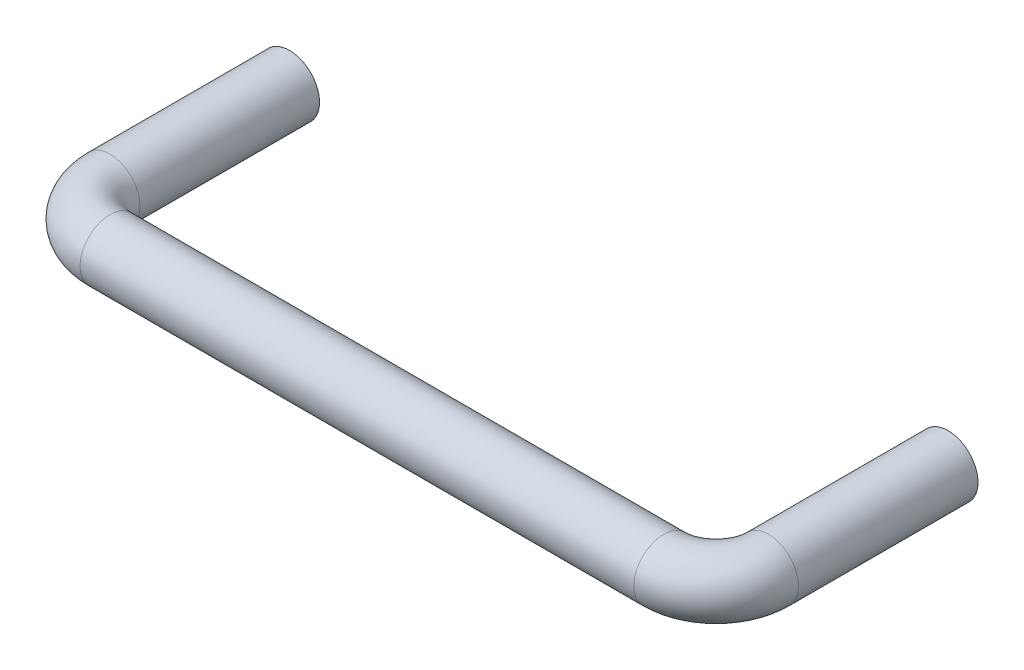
ISO-10303-21;
HEADER;
FILE_DESCRIPTION(('STEP AP214'),'2;1');
FILE_NAME('part.step','',(''),(''),'','','');
FILE_SCHEMA(('AUTOMOTIVE_DESIGN { 1 0 10303 214 1 1 1 1 }'));
ENDSEC;
DATA;
#1=APPLICATION_CONTEXT('core data for automotive mechanical design processes');
#2=APPLICATION_PROTOCOL_DEFINITION('international standard','automotive_design',2000,#1);
#3=PRODUCT_CONTEXT('',#1,'mechanical');
#4=PRODUCT('Part','Part','',(#3));
#5=PRODUCT_RELATED_PRODUCT_CATEGORY('part','',(#4));
#6=PRODUCT_DEFINITION_FORMATION('','',#4);
#7=PRODUCT_DEFINITION_CONTEXT('part definition',#1,'design');
#8=PRODUCT_DEFINITION('design','',#6,#7);
#9=PRODUCT_DEFINITION_SHAPE('','',#8);
#10=(LENGTH_UNIT() NAMED_UNIT(*) SI_UNIT(.MILLI.,.METRE.));
#11=(NAMED_UNIT(*) PLANE_ANGLE_UNIT() SI_UNIT($,.RADIAN.));
#12=(NAMED_UNIT(*) SI_UNIT($,.STERADIAN.) SOLID_ANGLE_UNIT());
#13=UNCERTAINTY_MEASURE_WITH_UNIT(LENGTH_MEASURE(1.E-05),#10,'distance_accuracy_value','');
#14=(GEOMETRIC_REPRESENTATION_CONTEXT(3) GLOBAL_UNCERTAINTY_ASSIGNED_CONTEXT((#13)) GLOBAL_UNIT_ASSIGNED_CONTEXT((#10,
#11,#12)) REPRESENTATION_CONTEXT('',''));
#15=CARTESIAN_POINT('',(0.,0.,0.));
#16=DIRECTION('',(0.,0.,1.));
#17=DIRECTION('',(1.,0.,0.));
#18=AXIS2_PLACEMENT_3D('',#15,#16,#17);
#19=CARTESIAN_POINT('',(-2.53,2.538705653,10.));
#20=DIRECTION('',(0.,0.,-1.));
#21=DIRECTION('',(1.,0.,0.));
#22=AXIS2_PLACEMENT_3D('',#19,#20,#21);
#23=PLANE('',#22);
#24=CARTESIAN_POINT('',(0.,0.,10.));
#25=DIRECTION('',(0.,0.,-1.));
#26=DIRECTION('',(0.,1.,0.));
#27=AXIS2_PLACEMENT_3D('',#24,#25,#26);
#28=CIRCLE('',#27,2.5);
#29=CARTESIAN_POINT('',(0.,2.5,10.));
#30=VERTEX_POINT('',#29);
#31=EDGE_CURVE('E33',#30,#30,#28,.T.);
#32=ORIENTED_EDGE('',*,*,#31,.T.);
#33=EDGE_LOOP('',(#32));
#34=FACE_BOUND('',#33,.T.);
#35=ADVANCED_FACE('F12',(#34),#23,.T.);
#36=CARTESIAN_POINT('',(0.,0.,10.));
#37=DIRECTION('',(0.,0.,-1.));
#38=DIRECTION('',(0.,1.,0.));
#39=AXIS2_PLACEMENT_3D('',#36,#37,#38);
#40=CYLINDRICAL_SURFACE('',#39,2.5);
#41=CARTESIAN_POINT('',(0.,0.,0.449999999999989));
#42=DIRECTION('',(0.,0.,1.));
#43=DIRECTION('',(1.,0.,0.));
#44=AXIS2_PLACEMENT_3D('',#41,#42,#43);
#45=CIRCLE('',#44,2.5);
#46=CARTESIAN_POINT('',(2.5,0.,0.449999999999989));
#47=VERTEX_POINT('',#46);
#48=EDGE_CURVE('E19',#47,#47,#45,.F.);
#49=ORIENTED_EDGE('',*,*,#48,.T.);
#50=EDGE_LOOP('',(#49));
#51=FACE_BOUND('',#50,.T.);
#52=ORIENTED_EDGE('',*,*,#31,.F.);
#53=EDGE_LOOP('',(#52));
#54=FACE_BOUND('',#53,.T.);
#55=ADVANCED_FACE('F77',(#51,#54),#40,.F.);
#56=CARTESIAN_POINT('',(-4.06192904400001,4.048,0.));
#57=DIRECTION('',(0.,0.,1.));
#58=DIRECTION('',(0.,-1.,0.));
#59=AXIS2_PLACEMENT_3D('',#56,#57,#58);
#60=PLANE('',#59);
#61=CARTESIAN_POINT('',(0.,0.,0.));
#62=DIRECTION('',(0.,0.,1.));
#63=DIRECTION('',(1.,0.,0.));
#64=AXIS2_PLACEMENT_3D('',#61,#62,#63);
#65=CIRCLE('',#64,2.95);
#66=CARTESIAN_POINT('',(2.95,0.,0.));
#67=VERTEX_POINT('',#66);
#68=EDGE_CURVE('E8',#67,#67,#65,.T.);
#69=ORIENTED_EDGE('',*,*,#68,.T.);
#70=EDGE_LOOP('',(#69));
#71=FACE_BOUND('',#70,.T.);
#72=CARTESIAN_POINT('',(0.,0.,0.));
#73=DIRECTION('',(0.,0.,-1.));
#74=DIRECTION('',(0.,1.,0.));
#75=AXIS2_PLACEMENT_3D('',#72,#73,#74);
#76=CIRCLE('',#75,4.);
#77=CARTESIAN_POINT('',(0.,4.,0.));
#78=VERTEX_POINT('',#77);
#79=EDGE_CURVE('E36',#78,#78,#76,.F.);
#80=ORIENTED_EDGE('',*,*,#79,.F.);
#81=EDGE_LOOP('',(#80));
#82=FACE_BOUND('',#81,.T.);
#83=ADVANCED_FACE('F66',(#71,#82),#60,.F.);
#84=CARTESIAN_POINT('',(0.,0.,24.));
#85=DIRECTION('',(0.,0.,-1.));
#86=DIRECTION('',(0.,1.,0.));
#87=AXIS2_PLACEMENT_3D('',#84,#85,#86);
#88=CYLINDRICAL_SURFACE('',#87,4.);
#89=ORIENTED_EDGE('',*,*,#79,.T.);
#90=EDGE_LOOP('',(#89));
#91=FACE_BOUND('',#90,.T.);
#92=CARTESIAN_POINT('',(0.,0.,24.));
#93=DIRECTION('',(0.,0.,1.));
#94=DIRECTION('',(0.,-1.,0.));
#95=AXIS2_PLACEMENT_3D('',#92,#93,#94);
#96=CIRCLE('',#95,4.);
#97=CARTESIAN_POINT('',(0.,-4.,24.));
#98=VERTEX_POINT('',#97);
#99=EDGE_CURVE('E39',#98,#98,#96,.T.);
#100=ORIENTED_EDGE('',*,*,#99,.F.);
#101=EDGE_LOOP('',(#100));
#102=FACE_BOUND('',#101,.T.);
#103=ADVANCED_FACE('F64',(#91,#102),#88,.T.);
#104=CARTESIAN_POINT('',(7.,0.,24.));
#105=DIRECTION('',(0.,1.,0.));
#106=DIRECTION('',(-1.,0.,0.));
#107=AXIS2_PLACEMENT_3D('',#104,#105,#106);
#108=TOROIDAL_SURFACE('',#107,7.,4.);
#109=ORIENTED_EDGE('',*,*,#99,.T.);
#110=EDGE_LOOP('',(#109));
#111=FACE_BOUND('',#110,.T.);
#112=CARTESIAN_POINT('',(7.,0.,31.));
#113=DIRECTION('',(1.,0.,0.));
#114=DIRECTION('',(0.,1.,0.));
#115=AXIS2_PLACEMENT_3D('',#112,#113,#114);
#116=CIRCLE('',#115,4.);
#117=CARTESIAN_POINT('',(7.,4.,31.));
#118=VERTEX_POINT('',#117);
#119=EDGE_CURVE('E46',#118,#118,#116,.T.);
#120=ORIENTED_EDGE('',*,*,#119,.F.);
#121=EDGE_LOOP('',(#120));
#122=FACE_BOUND('',#121,.T.);
#123=ADVANCED_FACE('F61',(#111,#122),#108,.T.);
#124=CARTESIAN_POINT('',(7.,0.,31.));
#125=DIRECTION('',(1.,0.,0.));
#126=DIRECTION('',(0.,1.,0.));
#127=AXIS2_PLACEMENT_3D('',#124,#125,#126);
#128=CYLINDRICAL_SURFACE('',#127,4.);
#129=ORIENTED_EDGE('',*,*,#119,.T.);
#130=EDGE_LOOP('',(#129));
#131=FACE_BOUND('',#130,.T.);
#132=CARTESIAN_POINT('',(81.,0.,31.));
#133=DIRECTION('',(1.,0.,0.));
#134=DIRECTION('',(0.,1.,0.));
#135=AXIS2_PLACEMENT_3D('',#132,#133,#134);
#136=CIRCLE('',#135,4.);
#137=CARTESIAN_POINT('',(81.,4.,31.));
#138=VERTEX_POINT('',#137);
#139=EDGE_CURVE('E49',#138,#138,#136,.T.);
#140=ORIENTED_EDGE('',*,*,#139,.F.);
#141=EDGE_LOOP('',(#140));
#142=FACE_BOUND('',#141,.T.);
#143=ADVANCED_FACE('F75',(#131,#142),#128,.T.);
#144=CARTESIAN_POINT('',(81.,0.,24.));
#145=DIRECTION('',(0.,1.,0.));
#146=DIRECTION('',(-1.,0.,0.));
#147=AXIS2_PLACEMENT_3D('',#144,#145,#146);
#148=TOROIDAL_SURFACE('',#147,7.,4.);
#149=ORIENTED_EDGE('',*,*,#139,.T.);
#150=EDGE_LOOP('',(#149));
#151=FACE_BOUND('',#150,.T.);
#152=CARTESIAN_POINT('',(88.,0.,24.));
#153=DIRECTION('',(0.,0.,-1.));
#154=DIRECTION('',(0.,1.,0.));
#155=AXIS2_PLACEMENT_3D('',#152,#153,#154);
#156=CIRCLE('',#155,4.);
#157=CARTESIAN_POINT('',(88.,4.,24.));
#158=VERTEX_POINT('',#157);
#159=EDGE_CURVE('E43',#158,#158,#156,.T.);
#160=ORIENTED_EDGE('',*,*,#159,.F.);
#161=EDGE_LOOP('',(#160));
#162=FACE_BOUND('',#161,.T.);
#163=ADVANCED_FACE('F103',(#151,#162),#148,.T.);
#164=CARTESIAN_POINT('',(88.,0.,24.));
#165=DIRECTION('',(0.,0.,-1.));
#166=DIRECTION('',(0.,1.,0.));
#167=AXIS2_PLACEMENT_3D('',#164,#165,#166);
#168=CYLINDRICAL_SURFACE('',#167,4.);
#169=ORIENTED_EDGE('',*,*,#159,.T.);
#170=EDGE_LOOP('',(#169));
#171=FACE_BOUND('',#170,.T.);
#172=CARTESIAN_POINT('',(88.,0.,0.));
#173=DIRECTION('',(0.,0.,-1.));
#174=DIRECTION('',(0.,1.,0.));
#175=AXIS2_PLACEMENT_3D('',#172,#173,#174);
#176=CIRCLE('',#175,4.);
#177=CARTESIAN_POINT('',(88.,4.,0.));
#178=VERTEX_POINT('',#177);
#179=EDGE_CURVE('E40',#178,#178,#176,.T.);
#180=ORIENTED_EDGE('',*,*,#179,.F.);
#181=EDGE_LOOP('',(#180));
#182=FACE_BOUND('',#181,.T.);
#183=ADVANCED_FACE('F99',(#171,#182),#168,.T.);
#184=CARTESIAN_POINT('',(92.061929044,4.048,0.));
#185=DIRECTION('',(0.,0.,-1.));
#186=DIRECTION('',(0.,-1.,0.));
#187=AXIS2_PLACEMENT_3D('',#184,#185,#186);
#188=PLANE('',#187);
#189=CARTESIAN_POINT('',(88.,0.,0.));
#190=DIRECTION('',(0.,0.,-1.));
#191=DIRECTION('',(-1.,0.,0.));
#192=AXIS2_PLACEMENT_3D('',#189,#190,#191);
#193=CIRCLE('',#192,2.95);
#194=CARTESIAN_POINT('',(85.05,0.,0.));
#195=VERTEX_POINT('',#194);
#196=EDGE_CURVE('E27',#195,#195,#193,.F.);
#197=ORIENTED_EDGE('',*,*,#196,.T.);
#198=EDGE_LOOP('',(#197));
#199=FACE_BOUND('',#198,.T.);
#200=ORIENTED_EDGE('',*,*,#179,.T.);
#201=EDGE_LOOP('',(#200));
#202=FACE_BOUND('',#201,.T.);
#203=ADVANCED_FACE('F93',(#199,#202),#188,.T.);
#204=CARTESIAN_POINT('',(90.53,2.538705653,10.));
#205=DIRECTION('',(0.,0.,1.));
#206=DIRECTION('',(-1.,0.,0.));
#207=AXIS2_PLACEMENT_3D('',#204,#205,#206);
#208=PLANE('',#207);
#209=CARTESIAN_POINT('',(88.,0.,10.));
#210=DIRECTION('',(0.,0.,-1.));
#211=DIRECTION('',(0.,1.,0.));
#212=AXIS2_PLACEMENT_3D('',#209,#210,#211);
#213=CIRCLE('',#212,2.5);
#214=CARTESIAN_POINT('',(88.,2.5,10.));
#215=VERTEX_POINT('',#214);
#216=EDGE_CURVE('E32',#215,#215,#213,.T.);
#217=ORIENTED_EDGE('',*,*,#216,.T.);
#218=EDGE_LOOP('',(#217));
#219=FACE_BOUND('',#218,.T.);
#220=ADVANCED_FACE('F84',(#219),#208,.F.);
#221=CARTESIAN_POINT('',(88.,0.,10.));
#222=DIRECTION('',(0.,0.,-1.));
#223=DIRECTION('',(0.,1.,0.));
#224=AXIS2_PLACEMENT_3D('',#221,#222,#223);
#225=CYLINDRICAL_SURFACE('',#224,2.5);
#226=CARTESIAN_POINT('',(88.,0.,0.450000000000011));
#227=DIRECTION('',(0.,0.,-1.));
#228=DIRECTION('',(-1.,0.,0.));
#229=AXIS2_PLACEMENT_3D('',#226,#227,#228);
#230=CIRCLE('',#229,2.5);
#231=CARTESIAN_POINT('',(85.5,0.,0.450000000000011));
#232=VERTEX_POINT('',#231);
#233=EDGE_CURVE('E23',#232,#232,#230,.T.);
#234=ORIENTED_EDGE('',*,*,#233,.T.);
#235=EDGE_LOOP('',(#234));
#236=FACE_BOUND('',#235,.T.);
#237=ORIENTED_EDGE('',*,*,#216,.F.);
#238=EDGE_LOOP('',(#237));
#239=FACE_BOUND('',#238,.T.);
#240=ADVANCED_FACE('F81',(#236,#239),#225,.F.);
#241=CARTESIAN_POINT('',(88.,0.,0.));
#242=DIRECTION('',(0.,0.,-1.));
#243=DIRECTION('',(-1.,0.,0.));
#244=AXIS2_PLACEMENT_3D('',#241,#242,#243);
#245=CONICAL_SURFACE('',#244,2.95,0.785398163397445);
#246=ORIENTED_EDGE('',*,*,#233,.F.);
#247=EDGE_LOOP('',(#246));
#248=FACE_BOUND('',#247,.T.);
#249=ORIENTED_EDGE('',*,*,#196,.F.);
#250=EDGE_LOOP('',(#249));
#251=FACE_BOUND('',#250,.T.);
#252=ADVANCED_FACE('F83',(#248,#251),#245,.F.);
#253=CARTESIAN_POINT('',(0.,0.,0.449999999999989));
#254=DIRECTION('',(0.,0.,-1.));
#255=DIRECTION('',(-1.,0.,0.));
#256=AXIS2_PLACEMENT_3D('',#253,#254,#255);
#257=CONICAL_SURFACE('',#256,2.5,0.785398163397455);
#258=ORIENTED_EDGE('',*,*,#68,.F.);
#259=EDGE_LOOP('',(#258));
#260=FACE_BOUND('',#259,.T.);
#261=ORIENTED_EDGE('',*,*,#48,.F.);
#262=EDGE_LOOP('',(#261));
#263=FACE_BOUND('',#262,.T.);
#264=ADVANCED_FACE('F14',(#260,#263),#257,.F.);
#265=CLOSED_SHELL('',(#35,#55,#83,#103,#123,#143,#163,#183,#203,#220,#240,#252,#264));
#266=MANIFOLD_SOLID_BREP('B1',#265);
#267=ADVANCED_BREP_SHAPE_REPRESENTATION('',(#18,#266),#14);
#268=SHAPE_DEFINITION_REPRESENTATION(#9,#267);
ENDSEC;
END-ISO-10303-21;
